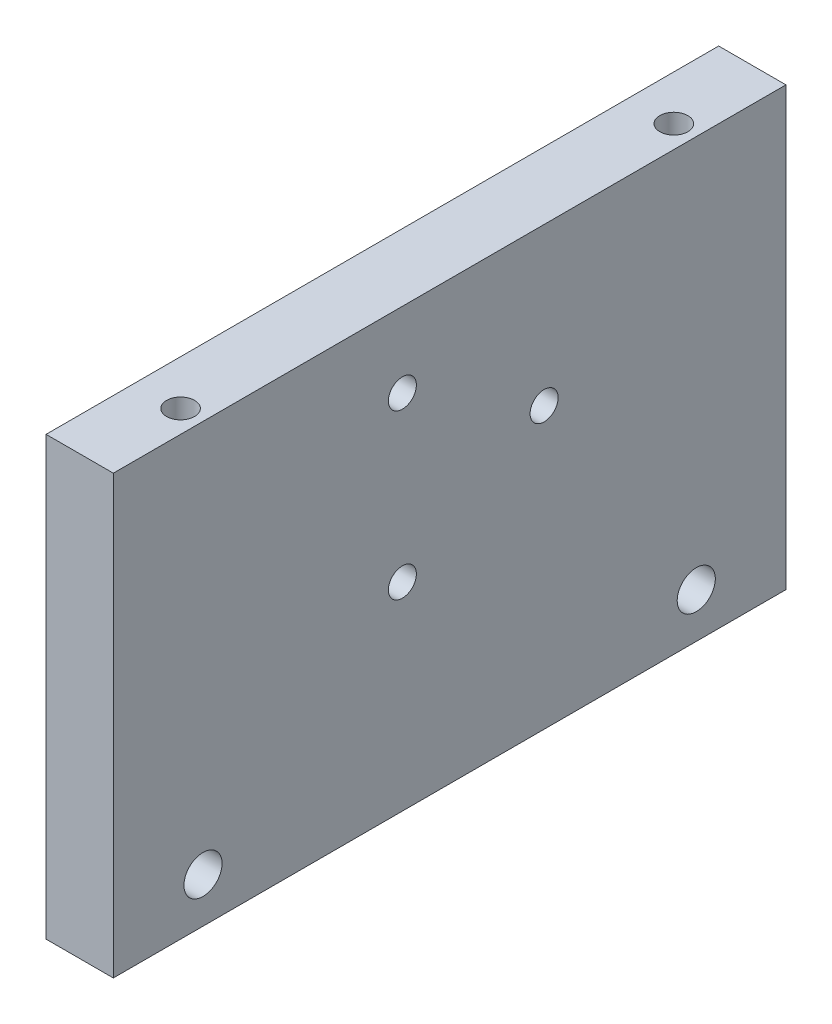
ISO-10303-21;
HEADER;
FILE_DESCRIPTION(('STEP AP214'),'2;1');
FILE_NAME('part.step','',(''),(''),'','','');
FILE_SCHEMA(('AUTOMOTIVE_DESIGN { 1 0 10303 214 1 1 1 1 }'));
ENDSEC;
DATA;
#1=APPLICATION_CONTEXT('core data for automotive mechanical design processes');
#2=APPLICATION_PROTOCOL_DEFINITION('international standard','automotive_design',2000,#1);
#3=PRODUCT_CONTEXT('',#1,'mechanical');
#4=PRODUCT('Part','Part','',(#3));
#5=PRODUCT_RELATED_PRODUCT_CATEGORY('part','',(#4));
#6=PRODUCT_DEFINITION_FORMATION('','',#4);
#7=PRODUCT_DEFINITION_CONTEXT('part definition',#1,'design');
#8=PRODUCT_DEFINITION('design','',#6,#7);
#9=PRODUCT_DEFINITION_SHAPE('','',#8);
#10=(LENGTH_UNIT() NAMED_UNIT(*) SI_UNIT(.MILLI.,.METRE.));
#11=(NAMED_UNIT(*) PLANE_ANGLE_UNIT() SI_UNIT($,.RADIAN.));
#12=(NAMED_UNIT(*) SI_UNIT($,.STERADIAN.) SOLID_ANGLE_UNIT());
#13=UNCERTAINTY_MEASURE_WITH_UNIT(LENGTH_MEASURE(1.E-05),#10,'distance_accuracy_value','');
#14=(GEOMETRIC_REPRESENTATION_CONTEXT(3) GLOBAL_UNCERTAINTY_ASSIGNED_CONTEXT((#13)) GLOBAL_UNIT_ASSIGNED_CONTEXT((#10,
#11,#12)) REPRESENTATION_CONTEXT('',''));
#15=CARTESIAN_POINT('',(0.,0.,0.));
#16=DIRECTION('',(0.,0.,1.));
#17=DIRECTION('',(1.,0.,0.));
#18=AXIS2_PLACEMENT_3D('',#15,#16,#17);
#19=CARTESIAN_POINT('',(3.,-19.5,-30.));
#20=DIRECTION('',(0.,0.,1.));
#21=DIRECTION('',(1.,0.,0.));
#22=AXIS2_PLACEMENT_3D('',#19,#20,#21);
#23=PLANE('',#22);
#24=DIRECTION('',(0.,1.,0.));
#25=VECTOR('',#24,1.);
#26=CARTESIAN_POINT('',(-3.,-19.5,-30.));
#27=LINE('',#26,#25);
#28=CARTESIAN_POINT('',(-3.,-19.5,-30.));
#29=VERTEX_POINT('',#28);
#30=CARTESIAN_POINT('',(-3.,19.5,-30.));
#31=VERTEX_POINT('',#30);
#32=EDGE_CURVE('E131',#29,#31,#27,.T.);
#33=ORIENTED_EDGE('',*,*,#32,.T.);
#34=DIRECTION('',(-1.,0.,0.));
#35=VECTOR('',#34,1.);
#36=CARTESIAN_POINT('',(3.,19.5,-30.));
#37=LINE('',#36,#35);
#38=CARTESIAN_POINT('',(3.,19.5,-30.));
#39=VERTEX_POINT('',#38);
#40=EDGE_CURVE('E11',#39,#31,#37,.T.);
#41=ORIENTED_EDGE('',*,*,#40,.F.);
#42=DIRECTION('',(0.,1.,0.));
#43=VECTOR('',#42,1.);
#44=CARTESIAN_POINT('',(3.,-19.5,-30.));
#45=LINE('',#44,#43);
#46=CARTESIAN_POINT('',(3.,-19.5,-30.));
#47=VERTEX_POINT('',#46);
#48=EDGE_CURVE('E132',#47,#39,#45,.T.);
#49=ORIENTED_EDGE('',*,*,#48,.F.);
#50=DIRECTION('',(-1.,0.,0.));
#51=VECTOR('',#50,1.);
#52=CARTESIAN_POINT('',(3.,-19.5,-30.));
#53=LINE('',#52,#51);
#54=EDGE_CURVE('E138',#47,#29,#53,.T.);
#55=ORIENTED_EDGE('',*,*,#54,.T.);
#56=EDGE_LOOP('',(#33,#41,#49,#55));
#57=FACE_BOUND('',#56,.T.);
#58=ADVANCED_FACE('F36',(#57),#23,.F.);
#59=CARTESIAN_POINT('',(3.,19.5,30.));
#60=DIRECTION('',(0.,-1.,0.));
#61=DIRECTION('',(0.,0.,-1.));
#62=AXIS2_PLACEMENT_3D('',#59,#60,#61);
#63=PLANE('',#62);
#64=CARTESIAN_POINT('',(1.,19.5,-22.));
#65=DIRECTION('',(0.,1.,0.));
#66=DIRECTION('',(0.,0.,1.));
#67=AXIS2_PLACEMENT_3D('',#64,#65,#66);
#68=CIRCLE('',#67,1.24999999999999);
#69=CARTESIAN_POINT('',(1.,19.5,-20.75));
#70=VERTEX_POINT('',#69);
#71=EDGE_CURVE('E101',#70,#70,#68,.T.);
#72=ORIENTED_EDGE('',*,*,#71,.F.);
#73=EDGE_LOOP('',(#72));
#74=FACE_BOUND('',#73,.T.);
#75=CARTESIAN_POINT('',(1.00000000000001,19.5,22.));
#76=DIRECTION('',(0.,1.,0.));
#77=DIRECTION('',(0.,0.,1.));
#78=AXIS2_PLACEMENT_3D('',#75,#76,#77);
#79=CIRCLE('',#78,1.24999999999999);
#80=CARTESIAN_POINT('',(1.00000000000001,19.5,23.25));
#81=VERTEX_POINT('',#80);
#82=EDGE_CURVE('E100',#81,#81,#79,.T.);
#83=ORIENTED_EDGE('',*,*,#82,.F.);
#84=EDGE_LOOP('',(#83));
#85=FACE_BOUND('',#84,.T.);
#86=DIRECTION('',(0.,0.,1.));
#87=VECTOR('',#86,1.);
#88=CARTESIAN_POINT('',(-3.,19.5,30.));
#89=LINE('',#88,#87);
#90=CARTESIAN_POINT('',(-3.,19.5,30.));
#91=VERTEX_POINT('',#90);
#92=EDGE_CURVE('E141',#31,#91,#89,.T.);
#93=ORIENTED_EDGE('',*,*,#92,.T.);
#94=DIRECTION('',(-1.,0.,0.));
#95=VECTOR('',#94,1.);
#96=CARTESIAN_POINT('',(3.,19.5,30.));
#97=LINE('',#96,#95);
#98=CARTESIAN_POINT('',(3.,19.5,30.));
#99=VERTEX_POINT('',#98);
#100=EDGE_CURVE('E44',#99,#91,#97,.T.);
#101=ORIENTED_EDGE('',*,*,#100,.F.);
#102=DIRECTION('',(0.,0.,1.));
#103=VECTOR('',#102,1.);
#104=CARTESIAN_POINT('',(3.,19.5,30.));
#105=LINE('',#104,#103);
#106=EDGE_CURVE('E83',#39,#99,#105,.T.);
#107=ORIENTED_EDGE('',*,*,#106,.F.);
#108=ORIENTED_EDGE('',*,*,#40,.T.);
#109=EDGE_LOOP('',(#93,#101,#107,#108));
#110=FACE_BOUND('',#109,.T.);
#111=ADVANCED_FACE('F165',(#74,#85,#110),#63,.F.);
#112=CARTESIAN_POINT('',(3.,-19.5,30.));
#113=DIRECTION('',(0.,0.,-1.));
#114=DIRECTION('',(-1.,0.,0.));
#115=AXIS2_PLACEMENT_3D('',#112,#113,#114);
#116=PLANE('',#115);
#117=DIRECTION('',(0.,-1.,0.));
#118=VECTOR('',#117,1.);
#119=CARTESIAN_POINT('',(-3.,-19.5,30.));
#120=LINE('',#119,#118);
#121=CARTESIAN_POINT('',(-3.,-19.5,30.));
#122=VERTEX_POINT('',#121);
#123=EDGE_CURVE('E70',#91,#122,#120,.T.);
#124=ORIENTED_EDGE('',*,*,#123,.T.);
#125=DIRECTION('',(-1.,0.,0.));
#126=VECTOR('',#125,1.);
#127=CARTESIAN_POINT('',(3.,-19.5,30.));
#128=LINE('',#127,#126);
#129=CARTESIAN_POINT('',(3.,-19.5,30.));
#130=VERTEX_POINT('',#129);
#131=EDGE_CURVE('E146',#130,#122,#128,.T.);
#132=ORIENTED_EDGE('',*,*,#131,.F.);
#133=DIRECTION('',(0.,-1.,0.));
#134=VECTOR('',#133,1.);
#135=CARTESIAN_POINT('',(3.,-19.5,30.));
#136=LINE('',#135,#134);
#137=EDGE_CURVE('E135',#99,#130,#136,.T.);
#138=ORIENTED_EDGE('',*,*,#137,.F.);
#139=ORIENTED_EDGE('',*,*,#100,.T.);
#140=EDGE_LOOP('',(#124,#132,#138,#139));
#141=FACE_BOUND('',#140,.T.);
#142=ADVANCED_FACE('F148',(#141),#116,.F.);
#143=CARTESIAN_POINT('',(3.,-19.5,30.));
#144=DIRECTION('',(0.,1.,0.));
#145=DIRECTION('',(0.,0.,1.));
#146=AXIS2_PLACEMENT_3D('',#143,#144,#145);
#147=PLANE('',#146);
#148=DIRECTION('',(0.,0.,-1.));
#149=VECTOR('',#148,1.);
#150=CARTESIAN_POINT('',(-3.,-19.5,30.));
#151=LINE('',#150,#149);
#152=EDGE_CURVE('E76',#122,#29,#151,.T.);
#153=ORIENTED_EDGE('',*,*,#152,.T.);
#154=ORIENTED_EDGE('',*,*,#54,.F.);
#155=DIRECTION('',(0.,0.,-1.));
#156=VECTOR('',#155,1.);
#157=CARTESIAN_POINT('',(3.,-19.5,30.));
#158=LINE('',#157,#156);
#159=EDGE_CURVE('E52',#130,#47,#158,.T.);
#160=ORIENTED_EDGE('',*,*,#159,.F.);
#161=ORIENTED_EDGE('',*,*,#131,.T.);
#162=EDGE_LOOP('',(#153,#154,#160,#161));
#163=FACE_BOUND('',#162,.T.);
#164=ADVANCED_FACE('F155',(#163),#147,.F.);
#165=CARTESIAN_POINT('',(3.,0.,0.));
#166=DIRECTION('',(-1.,0.,0.));
#167=DIRECTION('',(0.,0.,1.));
#168=AXIS2_PLACEMENT_3D('',#165,#166,#167);
#169=PLANE('',#168);
#170=CARTESIAN_POINT('',(3.,5.50000000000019,-8.42931393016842));
#171=DIRECTION('',(-1.,0.,0.));
#172=DIRECTION('',(0.,0.,1.));
#173=AXIS2_PLACEMENT_3D('',#170,#171,#172);
#174=CIRCLE('',#173,1.25);
#175=CARTESIAN_POINT('',(3.,5.50000000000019,-7.17931393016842));
#176=VERTEX_POINT('',#175);
#177=EDGE_CURVE('E235',#176,#176,#174,.T.);
#178=ORIENTED_EDGE('',*,*,#177,.T.);
#179=EDGE_LOOP('',(#178));
#180=FACE_BOUND('',#179,.T.);
#181=CARTESIAN_POINT('',(3.,12.8009618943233,4.21521231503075));
#182=DIRECTION('',(-1.,0.,0.));
#183=DIRECTION('',(0.,0.,1.));
#184=AXIS2_PLACEMENT_3D('',#181,#182,#183);
#185=CIRCLE('',#184,1.25);
#186=CARTESIAN_POINT('',(3.,12.8009618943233,5.46521231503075));
#187=VERTEX_POINT('',#186);
#188=EDGE_CURVE('E228',#187,#187,#185,.T.);
#189=ORIENTED_EDGE('',*,*,#188,.T.);
#190=EDGE_LOOP('',(#189));
#191=FACE_BOUND('',#190,.T.);
#192=CARTESIAN_POINT('',(3.,-1.80096189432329,4.21521231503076));
#193=DIRECTION('',(-1.,0.,0.));
#194=DIRECTION('',(0.,0.,1.));
#195=AXIS2_PLACEMENT_3D('',#192,#193,#194);
#196=CIRCLE('',#195,1.25);
#197=CARTESIAN_POINT('',(3.,-1.80096189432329,5.46521231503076));
#198=VERTEX_POINT('',#197);
#199=EDGE_CURVE('E107',#198,#198,#196,.T.);
#200=ORIENTED_EDGE('',*,*,#199,.T.);
#201=EDGE_LOOP('',(#200));
#202=FACE_BOUND('',#201,.T.);
#203=CARTESIAN_POINT('',(3.,-15.5,-22.));
#204=DIRECTION('',(-1.,0.,0.));
#205=DIRECTION('',(0.,0.,1.));
#206=AXIS2_PLACEMENT_3D('',#203,#204,#205);
#207=CIRCLE('',#206,1.7);
#208=CARTESIAN_POINT('',(3.,-15.5,-20.3));
#209=VERTEX_POINT('',#208);
#210=EDGE_CURVE('E119',#209,#209,#207,.T.);
#211=ORIENTED_EDGE('',*,*,#210,.T.);
#212=EDGE_LOOP('',(#211));
#213=FACE_BOUND('',#212,.T.);
#214=CARTESIAN_POINT('',(3.,-15.5,22.));
#215=DIRECTION('',(-1.,0.,0.));
#216=DIRECTION('',(0.,0.,1.));
#217=AXIS2_PLACEMENT_3D('',#214,#215,#216);
#218=CIRCLE('',#217,1.7);
#219=CARTESIAN_POINT('',(3.,-15.5,23.7));
#220=VERTEX_POINT('',#219);
#221=EDGE_CURVE('E128',#220,#220,#218,.T.);
#222=ORIENTED_EDGE('',*,*,#221,.T.);
#223=EDGE_LOOP('',(#222));
#224=FACE_BOUND('',#223,.T.);
#225=ORIENTED_EDGE('',*,*,#48,.T.);
#226=ORIENTED_EDGE('',*,*,#106,.T.);
#227=ORIENTED_EDGE('',*,*,#137,.T.);
#228=ORIENTED_EDGE('',*,*,#159,.T.);
#229=EDGE_LOOP('',(#225,#226,#227,#228));
#230=FACE_BOUND('',#229,.T.);
#231=ADVANCED_FACE('F157',(#180,#191,#202,#213,#224,#230),#169,.F.);
#232=CARTESIAN_POINT('',(-3.,0.,0.));
#233=DIRECTION('',(-1.,0.,0.));
#234=DIRECTION('',(0.,0.,1.));
#235=AXIS2_PLACEMENT_3D('',#232,#233,#234);
#236=PLANE('',#235);
#237=CARTESIAN_POINT('',(-3.,5.50000000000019,-8.42931393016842));
#238=DIRECTION('',(-1.,0.,0.));
#239=DIRECTION('',(0.,0.,1.));
#240=AXIS2_PLACEMENT_3D('',#237,#238,#239);
#241=CIRCLE('',#240,1.24999999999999);
#242=CARTESIAN_POINT('',(-3.,5.50000000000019,-7.17931393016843));
#243=VERTEX_POINT('',#242);
#244=EDGE_CURVE('E213',#243,#243,#241,.T.);
#245=ORIENTED_EDGE('',*,*,#244,.F.);
#246=EDGE_LOOP('',(#245));
#247=FACE_BOUND('',#246,.T.);
#248=CARTESIAN_POINT('',(-3.,12.8009618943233,4.21521231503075));
#249=DIRECTION('',(-1.,0.,0.));
#250=DIRECTION('',(0.,0.,1.));
#251=AXIS2_PLACEMENT_3D('',#248,#249,#250);
#252=CIRCLE('',#251,1.24999999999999);
#253=CARTESIAN_POINT('',(-3.,12.8009618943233,5.46521231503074));
#254=VERTEX_POINT('',#253);
#255=EDGE_CURVE('E217',#254,#254,#252,.T.);
#256=ORIENTED_EDGE('',*,*,#255,.F.);
#257=EDGE_LOOP('',(#256));
#258=FACE_BOUND('',#257,.T.);
#259=CARTESIAN_POINT('',(-3.,-1.80096189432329,4.21521231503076));
#260=DIRECTION('',(-1.,0.,0.));
#261=DIRECTION('',(0.,0.,1.));
#262=AXIS2_PLACEMENT_3D('',#259,#260,#261);
#263=CIRCLE('',#262,1.24999999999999);
#264=CARTESIAN_POINT('',(-3.,-1.80096189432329,5.46521231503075));
#265=VERTEX_POINT('',#264);
#266=EDGE_CURVE('E221',#265,#265,#263,.T.);
#267=ORIENTED_EDGE('',*,*,#266,.F.);
#268=EDGE_LOOP('',(#267));
#269=FACE_BOUND('',#268,.T.);
#270=CARTESIAN_POINT('',(-3.,-15.5,-22.));
#271=DIRECTION('',(-1.,0.,0.));
#272=DIRECTION('',(0.,0.,1.));
#273=AXIS2_PLACEMENT_3D('',#270,#271,#272);
#274=CIRCLE('',#273,3.15);
#275=CARTESIAN_POINT('',(-3.,-15.5,-18.85));
#276=VERTEX_POINT('',#275);
#277=EDGE_CURVE('E113',#276,#276,#274,.T.);
#278=ORIENTED_EDGE('',*,*,#277,.F.);
#279=EDGE_LOOP('',(#278));
#280=FACE_BOUND('',#279,.T.);
#281=CARTESIAN_POINT('',(-3.,-15.5,22.));
#282=DIRECTION('',(-1.,0.,0.));
#283=DIRECTION('',(0.,0.,1.));
#284=AXIS2_PLACEMENT_3D('',#281,#282,#283);
#285=CIRCLE('',#284,3.15);
#286=CARTESIAN_POINT('',(-3.,-15.5,25.15));
#287=VERTEX_POINT('',#286);
#288=EDGE_CURVE('E122',#287,#287,#285,.T.);
#289=ORIENTED_EDGE('',*,*,#288,.F.);
#290=EDGE_LOOP('',(#289));
#291=FACE_BOUND('',#290,.T.);
#292=ORIENTED_EDGE('',*,*,#32,.F.);
#293=ORIENTED_EDGE('',*,*,#152,.F.);
#294=ORIENTED_EDGE('',*,*,#123,.F.);
#295=ORIENTED_EDGE('',*,*,#92,.F.);
#296=EDGE_LOOP('',(#292,#293,#294,#295));
#297=FACE_BOUND('',#296,.T.);
#298=ADVANCED_FACE('F151',(#247,#258,#269,#280,#291,#297),#236,.T.);
#299=CARTESIAN_POINT('',(-3.,-15.5,22.));
#300=DIRECTION('',(-1.,0.,0.));
#301=DIRECTION('',(0.,0.,1.));
#302=AXIS2_PLACEMENT_3D('',#299,#300,#301);
#303=CYLINDRICAL_SURFACE('',#302,1.69999999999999);
#304=ORIENTED_EDGE('',*,*,#221,.F.);
#305=EDGE_LOOP('',(#304));
#306=FACE_BOUND('',#305,.T.);
#307=CARTESIAN_POINT('',(-1.54999999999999,-15.5,22.));
#308=DIRECTION('',(-1.,0.,0.));
#309=DIRECTION('',(0.,0.,1.));
#310=AXIS2_PLACEMENT_3D('',#307,#308,#309);
#311=CIRCLE('',#310,1.69999999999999);
#312=CARTESIAN_POINT('',(-1.54999999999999,-15.5,23.7));
#313=VERTEX_POINT('',#312);
#314=EDGE_CURVE('E125',#313,#313,#311,.T.);
#315=ORIENTED_EDGE('',*,*,#314,.T.);
#316=EDGE_LOOP('',(#315));
#317=FACE_BOUND('',#316,.T.);
#318=ADVANCED_FACE('F202',(#306,#317),#303,.F.);
#319=CARTESIAN_POINT('',(-3.,-15.5,22.));
#320=DIRECTION('',(-1.,0.,0.));
#321=DIRECTION('',(0.,0.,1.));
#322=AXIS2_PLACEMENT_3D('',#319,#320,#321);
#323=CONICAL_SURFACE('',#322,3.15,0.78539816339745);
#324=ORIENTED_EDGE('',*,*,#314,.F.);
#325=EDGE_LOOP('',(#324));
#326=FACE_BOUND('',#325,.T.);
#327=ORIENTED_EDGE('',*,*,#288,.T.);
#328=EDGE_LOOP('',(#327));
#329=FACE_BOUND('',#328,.T.);
#330=ADVANCED_FACE('F198',(#326,#329),#323,.F.);
#331=CARTESIAN_POINT('',(-3.,-15.5,-22.));
#332=DIRECTION('',(-1.,0.,0.));
#333=DIRECTION('',(0.,0.,1.));
#334=AXIS2_PLACEMENT_3D('',#331,#332,#333);
#335=CYLINDRICAL_SURFACE('',#334,1.69999999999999);
#336=ORIENTED_EDGE('',*,*,#210,.F.);
#337=EDGE_LOOP('',(#336));
#338=FACE_BOUND('',#337,.T.);
#339=CARTESIAN_POINT('',(-1.54999999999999,-15.5,-22.));
#340=DIRECTION('',(-1.,0.,0.));
#341=DIRECTION('',(0.,0.,1.));
#342=AXIS2_PLACEMENT_3D('',#339,#340,#341);
#343=CIRCLE('',#342,1.69999999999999);
#344=CARTESIAN_POINT('',(-1.54999999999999,-15.5,-20.3));
#345=VERTEX_POINT('',#344);
#346=EDGE_CURVE('E116',#345,#345,#343,.T.);
#347=ORIENTED_EDGE('',*,*,#346,.T.);
#348=EDGE_LOOP('',(#347));
#349=FACE_BOUND('',#348,.T.);
#350=ADVANCED_FACE('F194',(#338,#349),#335,.F.);
#351=CARTESIAN_POINT('',(-3.,-15.5,-22.));
#352=DIRECTION('',(-1.,0.,0.));
#353=DIRECTION('',(0.,0.,1.));
#354=AXIS2_PLACEMENT_3D('',#351,#352,#353);
#355=CONICAL_SURFACE('',#354,3.15,0.78539816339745);
#356=ORIENTED_EDGE('',*,*,#346,.F.);
#357=EDGE_LOOP('',(#356));
#358=FACE_BOUND('',#357,.T.);
#359=ORIENTED_EDGE('',*,*,#277,.T.);
#360=EDGE_LOOP('',(#359));
#361=FACE_BOUND('',#360,.T.);
#362=ADVANCED_FACE('F186',(#358,#361),#355,.F.);
#363=CARTESIAN_POINT('',(1.00000000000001,12.,22.));
#364=DIRECTION('',(0.,1.,0.));
#365=DIRECTION('',(0.,0.,1.));
#366=AXIS2_PLACEMENT_3D('',#363,#364,#365);
#367=CONICAL_SURFACE('',#366,1.24999999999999,1.02974425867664);
#368=CARTESIAN_POINT('',(1.,11.2489242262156,22.));
#369=VERTEX_POINT('',#368);
#370=VERTEX_LOOP('',#369);
#371=FACE_BOUND('',#370,.T.);
#372=CARTESIAN_POINT('',(1.00000000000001,12.,22.));
#373=DIRECTION('',(0.,1.,0.));
#374=DIRECTION('',(0.,0.,1.));
#375=AXIS2_PLACEMENT_3D('',#372,#373,#374);
#376=CIRCLE('',#375,1.24999999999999);
#377=CARTESIAN_POINT('',(1.00000000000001,12.,23.25));
#378=VERTEX_POINT('',#377);
#379=EDGE_CURVE('E104',#378,#378,#376,.T.);
#380=ORIENTED_EDGE('',*,*,#379,.T.);
#381=EDGE_LOOP('',(#380));
#382=FACE_BOUND('',#381,.T.);
#383=ADVANCED_FACE('F180',(#371,#382),#367,.F.);
#384=CARTESIAN_POINT('',(1.00000000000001,19.5,22.));
#385=DIRECTION('',(0.,1.,0.));
#386=DIRECTION('',(0.,0.,1.));
#387=AXIS2_PLACEMENT_3D('',#384,#385,#386);
#388=CYLINDRICAL_SURFACE('',#387,1.24999999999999);
#389=ORIENTED_EDGE('',*,*,#379,.F.);
#390=EDGE_LOOP('',(#389));
#391=FACE_BOUND('',#390,.T.);
#392=ORIENTED_EDGE('',*,*,#82,.T.);
#393=EDGE_LOOP('',(#392));
#394=FACE_BOUND('',#393,.T.);
#395=ADVANCED_FACE('F94',(#391,#394),#388,.F.);
#396=CARTESIAN_POINT('',(1.,12.,-22.));
#397=DIRECTION('',(0.,1.,0.));
#398=DIRECTION('',(0.,0.,1.));
#399=AXIS2_PLACEMENT_3D('',#396,#397,#398);
#400=CONICAL_SURFACE('',#399,1.24999999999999,1.02974425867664);
#401=CARTESIAN_POINT('',(0.999999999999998,11.2489242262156,-22.));
#402=VERTEX_POINT('',#401);
#403=VERTEX_LOOP('',#402);
#404=FACE_BOUND('',#403,.T.);
#405=CARTESIAN_POINT('',(1.,12.,-22.));
#406=DIRECTION('',(0.,1.,0.));
#407=DIRECTION('',(0.,0.,1.));
#408=AXIS2_PLACEMENT_3D('',#405,#406,#407);
#409=CIRCLE('',#408,1.24999999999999);
#410=CARTESIAN_POINT('',(1.,12.,-20.75));
#411=VERTEX_POINT('',#410);
#412=EDGE_CURVE('E98',#411,#411,#409,.T.);
#413=ORIENTED_EDGE('',*,*,#412,.T.);
#414=EDGE_LOOP('',(#413));
#415=FACE_BOUND('',#414,.T.);
#416=ADVANCED_FACE('F90',(#404,#415),#400,.F.);
#417=CARTESIAN_POINT('',(1.,19.5,-22.));
#418=DIRECTION('',(0.,1.,0.));
#419=DIRECTION('',(0.,0.,1.));
#420=AXIS2_PLACEMENT_3D('',#417,#418,#419);
#421=CYLINDRICAL_SURFACE('',#420,1.24999999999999);
#422=ORIENTED_EDGE('',*,*,#412,.F.);
#423=EDGE_LOOP('',(#422));
#424=FACE_BOUND('',#423,.T.);
#425=ORIENTED_EDGE('',*,*,#71,.T.);
#426=EDGE_LOOP('',(#425));
#427=FACE_BOUND('',#426,.T.);
#428=ADVANCED_FACE('F93',(#424,#427),#421,.F.);
#429=CARTESIAN_POINT('',(-3.,-1.80096189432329,4.21521231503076));
#430=DIRECTION('',(-1.,0.,0.));
#431=DIRECTION('',(0.,0.,1.));
#432=AXIS2_PLACEMENT_3D('',#429,#430,#431);
#433=CYLINDRICAL_SURFACE('',#432,1.24999999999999);
#434=ORIENTED_EDGE('',*,*,#199,.F.);
#435=EDGE_LOOP('',(#434));
#436=FACE_BOUND('',#435,.T.);
#437=ORIENTED_EDGE('',*,*,#266,.T.);
#438=EDGE_LOOP('',(#437));
#439=FACE_BOUND('',#438,.T.);
#440=ADVANCED_FACE('F247',(#436,#439),#433,.F.);
#441=CARTESIAN_POINT('',(-3.,12.8009618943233,4.21521231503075));
#442=DIRECTION('',(-1.,0.,0.));
#443=DIRECTION('',(0.,0.,1.));
#444=AXIS2_PLACEMENT_3D('',#441,#442,#443);
#445=CYLINDRICAL_SURFACE('',#444,1.24999999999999);
#446=ORIENTED_EDGE('',*,*,#188,.F.);
#447=EDGE_LOOP('',(#446));
#448=FACE_BOUND('',#447,.T.);
#449=ORIENTED_EDGE('',*,*,#255,.T.);
#450=EDGE_LOOP('',(#449));
#451=FACE_BOUND('',#450,.T.);
#452=ADVANCED_FACE('F241',(#448,#451),#445,.F.);
#453=CARTESIAN_POINT('',(-3.,5.50000000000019,-8.42931393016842));
#454=DIRECTION('',(-1.,0.,0.));
#455=DIRECTION('',(0.,0.,1.));
#456=AXIS2_PLACEMENT_3D('',#453,#454,#455);
#457=CYLINDRICAL_SURFACE('',#456,1.24999999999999);
#458=ORIENTED_EDGE('',*,*,#177,.F.);
#459=EDGE_LOOP('',(#458));
#460=FACE_BOUND('',#459,.T.);
#461=ORIENTED_EDGE('',*,*,#244,.T.);
#462=EDGE_LOOP('',(#461));
#463=FACE_BOUND('',#462,.T.);
#464=ADVANCED_FACE('F239',(#460,#463),#457,.F.);
#465=CLOSED_SHELL('',(#58,#111,#142,#164,#231,#298,#318,#330,#350,#362,#383,#395,#416,#428,#440,
#452,#464));
#466=MANIFOLD_SOLID_BREP('B2',#465);
#467=ADVANCED_BREP_SHAPE_REPRESENTATION('',(#18,#466),#14);
#468=SHAPE_DEFINITION_REPRESENTATION(#9,#467);
ENDSEC;
END-ISO-10303-21;
